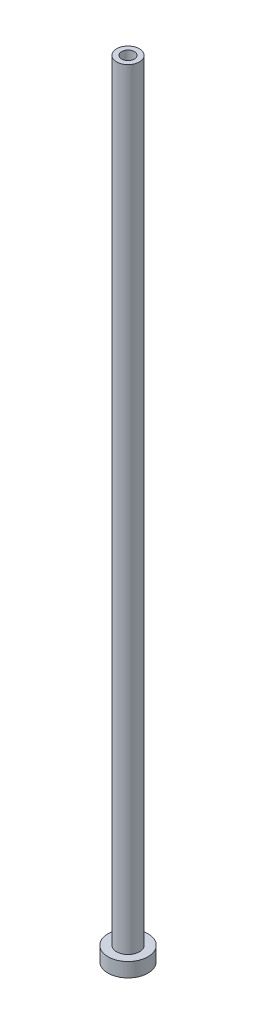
ISO-10303-21;
HEADER;
FILE_DESCRIPTION(('STEP AP214'),'2;1');
FILE_NAME('part.step','',(''),(''),'','','');
FILE_SCHEMA(('AUTOMOTIVE_DESIGN { 1 0 10303 214 1 1 1 1 }'));
ENDSEC;
DATA;
#1=APPLICATION_CONTEXT('core data for automotive mechanical design processes');
#2=APPLICATION_PROTOCOL_DEFINITION('international standard','automotive_design',2000,#1);
#3=PRODUCT_CONTEXT('',#1,'mechanical');
#4=PRODUCT('Part','Part','',(#3));
#5=PRODUCT_RELATED_PRODUCT_CATEGORY('part','',(#4));
#6=PRODUCT_DEFINITION_FORMATION('','',#4);
#7=PRODUCT_DEFINITION_CONTEXT('part definition',#1,'design');
#8=PRODUCT_DEFINITION('design','',#6,#7);
#9=PRODUCT_DEFINITION_SHAPE('','',#8);
#10=(LENGTH_UNIT() NAMED_UNIT(*) SI_UNIT(.MILLI.,.METRE.));
#11=(NAMED_UNIT(*) PLANE_ANGLE_UNIT() SI_UNIT($,.RADIAN.));
#12=(NAMED_UNIT(*) SI_UNIT($,.STERADIAN.) SOLID_ANGLE_UNIT());
#13=UNCERTAINTY_MEASURE_WITH_UNIT(LENGTH_MEASURE(1.E-05),#10,'distance_accuracy_value','');
#14=(GEOMETRIC_REPRESENTATION_CONTEXT(3) GLOBAL_UNCERTAINTY_ASSIGNED_CONTEXT((#13)) GLOBAL_UNIT_ASSIGNED_CONTEXT((#10,
#11,#12)) REPRESENTATION_CONTEXT('',''));
#15=CARTESIAN_POINT('',(0.,0.,0.));
#16=DIRECTION('',(0.,0.,1.));
#17=DIRECTION('',(1.,0.,0.));
#18=AXIS2_PLACEMENT_3D('',#15,#16,#17);
#19=CARTESIAN_POINT('',(0.,0.,0.));
#20=DIRECTION('',(0.,-1.,0.));
#21=DIRECTION('',(0.,0.,-1.));
#22=AXIS2_PLACEMENT_3D('',#19,#20,#21);
#23=CYLINDRICAL_SURFACE('',#22,7.);
#24=CARTESIAN_POINT('',(0.,-5.,0.));
#25=DIRECTION('',(0.,-1.,0.));
#26=DIRECTION('',(0.,0.,-1.));
#27=AXIS2_PLACEMENT_3D('',#24,#25,#26);
#28=CIRCLE('',#27,7.);
#29=CARTESIAN_POINT('',(0.,-5.,-7.));
#30=VERTEX_POINT('',#29);
#31=EDGE_CURVE('E41',#30,#30,#28,.T.);
#32=ORIENTED_EDGE('',*,*,#31,.F.);
#33=EDGE_LOOP('',(#32));
#34=FACE_BOUND('',#33,.T.);
#35=CARTESIAN_POINT('',(0.,0.,0.));
#36=DIRECTION('',(0.,-1.,0.));
#37=DIRECTION('',(0.,0.,-1.));
#38=AXIS2_PLACEMENT_3D('',#35,#36,#37);
#39=CIRCLE('',#38,7.);
#40=CARTESIAN_POINT('',(0.,0.,-7.));
#41=VERTEX_POINT('',#40);
#42=EDGE_CURVE('E8',#41,#41,#39,.T.);
#43=ORIENTED_EDGE('',*,*,#42,.T.);
#44=EDGE_LOOP('',(#43));
#45=FACE_BOUND('',#44,.T.);
#46=ADVANCED_FACE('F13',(#34,#45),#23,.T.);
#47=CARTESIAN_POINT('',(-7.,0.,0.));
#48=DIRECTION('',(0.,-1.,0.));
#49=DIRECTION('',(0.,0.,-1.));
#50=AXIS2_PLACEMENT_3D('',#47,#48,#49);
#51=PLANE('',#50);
#52=ORIENTED_EDGE('',*,*,#42,.F.);
#53=EDGE_LOOP('',(#52));
#54=FACE_BOUND('',#53,.T.);
#55=CARTESIAN_POINT('',(0.,0.,0.));
#56=DIRECTION('',(0.,-1.,0.));
#57=DIRECTION('',(0.,0.,-1.));
#58=AXIS2_PLACEMENT_3D('',#55,#56,#57);
#59=CIRCLE('',#58,4.);
#60=CARTESIAN_POINT('',(0.,0.,-4.));
#61=VERTEX_POINT('',#60);
#62=EDGE_CURVE('E19',#61,#61,#59,.T.);
#63=ORIENTED_EDGE('',*,*,#62,.T.);
#64=EDGE_LOOP('',(#63));
#65=FACE_BOUND('',#64,.T.);
#66=ADVANCED_FACE('F48',(#54,#65),#51,.F.);
#67=CARTESIAN_POINT('',(0.,0.,0.));
#68=DIRECTION('',(0.,-1.,0.));
#69=DIRECTION('',(0.,0.,-1.));
#70=AXIS2_PLACEMENT_3D('',#67,#68,#69);
#71=CYLINDRICAL_SURFACE('',#70,4.);
#72=ORIENTED_EDGE('',*,*,#62,.F.);
#73=EDGE_LOOP('',(#72));
#74=FACE_BOUND('',#73,.T.);
#75=CARTESIAN_POINT('',(0.,270.,0.));
#76=DIRECTION('',(0.,-1.,0.));
#77=DIRECTION('',(0.,0.,-1.));
#78=AXIS2_PLACEMENT_3D('',#75,#76,#77);
#79=CIRCLE('',#78,4.);
#80=CARTESIAN_POINT('',(0.,270.,-4.));
#81=VERTEX_POINT('',#80);
#82=EDGE_CURVE('E23',#81,#81,#79,.T.);
#83=ORIENTED_EDGE('',*,*,#82,.T.);
#84=EDGE_LOOP('',(#83));
#85=FACE_BOUND('',#84,.T.);
#86=ADVANCED_FACE('F54',(#74,#85),#71,.T.);
#87=CARTESIAN_POINT('',(-4.,270.,0.));
#88=DIRECTION('',(0.,-1.,0.));
#89=DIRECTION('',(0.,0.,-1.));
#90=AXIS2_PLACEMENT_3D('',#87,#88,#89);
#91=PLANE('',#90);
#92=ORIENTED_EDGE('',*,*,#82,.F.);
#93=EDGE_LOOP('',(#92));
#94=FACE_BOUND('',#93,.T.);
#95=CARTESIAN_POINT('',(0.,270.,0.));
#96=DIRECTION('',(0.,-1.,0.));
#97=DIRECTION('',(0.,0.,-1.));
#98=AXIS2_PLACEMENT_3D('',#95,#96,#97);
#99=CIRCLE('',#98,2.25);
#100=CARTESIAN_POINT('',(0.,270.,-2.25));
#101=VERTEX_POINT('',#100);
#102=EDGE_CURVE('E27',#101,#101,#99,.T.);
#103=ORIENTED_EDGE('',*,*,#102,.T.);
#104=EDGE_LOOP('',(#103));
#105=FACE_BOUND('',#104,.T.);
#106=ADVANCED_FACE('F60',(#94,#105),#91,.F.);
#107=CARTESIAN_POINT('',(0.,0.,0.));
#108=DIRECTION('',(0.,-1.,0.));
#109=DIRECTION('',(0.,0.,-1.));
#110=AXIS2_PLACEMENT_3D('',#107,#108,#109);
#111=CYLINDRICAL_SURFACE('',#110,2.25);
#112=ORIENTED_EDGE('',*,*,#102,.F.);
#113=EDGE_LOOP('',(#112));
#114=FACE_BOUND('',#113,.T.);
#115=CARTESIAN_POINT('',(0.,225.,0.));
#116=DIRECTION('',(0.,-1.,0.));
#117=DIRECTION('',(0.,0.,-1.));
#118=AXIS2_PLACEMENT_3D('',#115,#116,#117);
#119=CIRCLE('',#118,2.25);
#120=CARTESIAN_POINT('',(0.,225.,-2.25));
#121=VERTEX_POINT('',#120);
#122=EDGE_CURVE('E32',#121,#121,#119,.T.);
#123=ORIENTED_EDGE('',*,*,#122,.T.);
#124=EDGE_LOOP('',(#123));
#125=FACE_BOUND('',#124,.T.);
#126=ADVANCED_FACE('F66',(#114,#125),#111,.F.);
#127=CARTESIAN_POINT('',(0.,224.6,0.));
#128=DIRECTION('',(0.,-1.,0.));
#129=DIRECTION('',(0.,0.,-1.));
#130=AXIS2_PLACEMENT_3D('',#127,#128,#129);
#131=CONICAL_SURFACE('',#130,2.65,0.785398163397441);
#132=ORIENTED_EDGE('',*,*,#122,.F.);
#133=EDGE_LOOP('',(#132));
#134=FACE_BOUND('',#133,.T.);
#135=CARTESIAN_POINT('',(0.,224.6,0.));
#136=DIRECTION('',(0.,-1.,0.));
#137=DIRECTION('',(0.,0.,-1.));
#138=AXIS2_PLACEMENT_3D('',#135,#136,#137);
#139=CIRCLE('',#138,2.65);
#140=CARTESIAN_POINT('',(0.,224.6,-2.65));
#141=VERTEX_POINT('',#140);
#142=EDGE_CURVE('E35',#141,#141,#139,.T.);
#143=ORIENTED_EDGE('',*,*,#142,.T.);
#144=EDGE_LOOP('',(#143));
#145=FACE_BOUND('',#144,.T.);
#146=ADVANCED_FACE('F70',(#134,#145),#131,.F.);
#147=CARTESIAN_POINT('',(0.,0.,0.));
#148=DIRECTION('',(0.,-1.,0.));
#149=DIRECTION('',(0.,0.,-1.));
#150=AXIS2_PLACEMENT_3D('',#147,#148,#149);
#151=CYLINDRICAL_SURFACE('',#150,2.65);
#152=ORIENTED_EDGE('',*,*,#142,.F.);
#153=EDGE_LOOP('',(#152));
#154=FACE_BOUND('',#153,.T.);
#155=CARTESIAN_POINT('',(0.,-5.,0.));
#156=DIRECTION('',(0.,-1.,0.));
#157=DIRECTION('',(0.,0.,-1.));
#158=AXIS2_PLACEMENT_3D('',#155,#156,#157);
#159=CIRCLE('',#158,2.65);
#160=CARTESIAN_POINT('',(0.,-5.,-2.65));
#161=VERTEX_POINT('',#160);
#162=EDGE_CURVE('E38',#161,#161,#159,.T.);
#163=ORIENTED_EDGE('',*,*,#162,.T.);
#164=EDGE_LOOP('',(#163));
#165=FACE_BOUND('',#164,.T.);
#166=ADVANCED_FACE('F74',(#154,#165),#151,.F.);
#167=CARTESIAN_POINT('',(-2.65,-5.,0.));
#168=DIRECTION('',(0.,1.,0.));
#169=DIRECTION('',(0.,0.,1.));
#170=AXIS2_PLACEMENT_3D('',#167,#168,#169);
#171=PLANE('',#170);
#172=ORIENTED_EDGE('',*,*,#162,.F.);
#173=EDGE_LOOP('',(#172));
#174=FACE_BOUND('',#173,.T.);
#175=ORIENTED_EDGE('',*,*,#31,.T.);
#176=EDGE_LOOP('',(#175));
#177=FACE_BOUND('',#176,.T.);
#178=ADVANCED_FACE('F45',(#174,#177),#171,.F.);
#179=CLOSED_SHELL('',(#46,#66,#86,#106,#126,#146,#166,#178));
#180=MANIFOLD_SOLID_BREP('B1',#179);
#181=ADVANCED_BREP_SHAPE_REPRESENTATION('',(#18,#180),#14);
#182=SHAPE_DEFINITION_REPRESENTATION(#9,#181);
ENDSEC;
END-ISO-10303-21;
